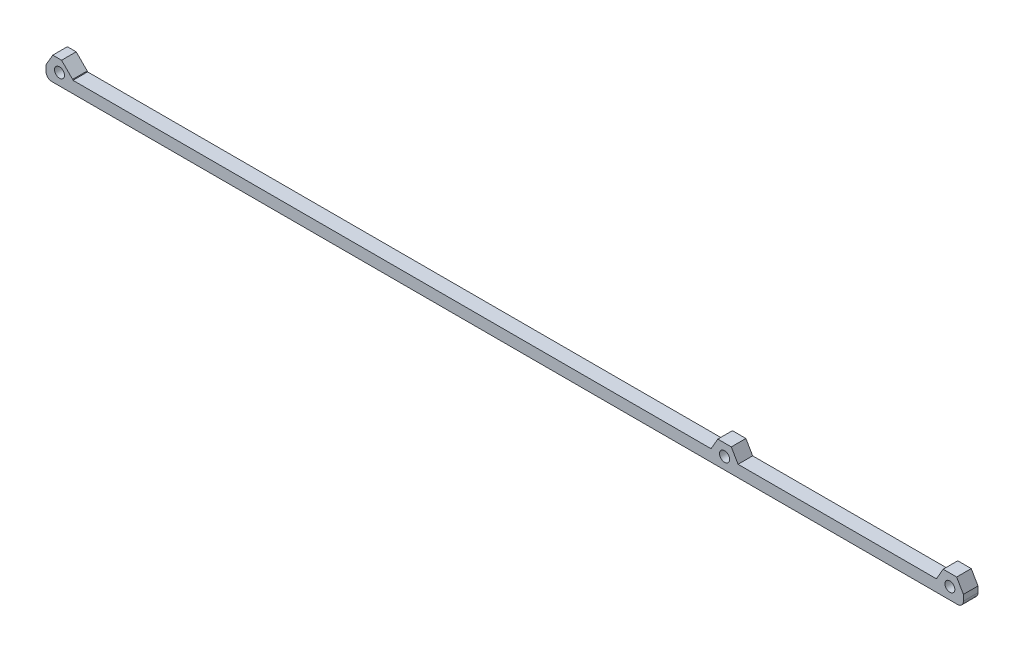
ISO-10303-21;
HEADER;
FILE_DESCRIPTION(('STEP AP214'),'2;1');
FILE_NAME('part.step','',(''),(''),'','','');
FILE_SCHEMA(('AUTOMOTIVE_DESIGN { 1 0 10303 214 1 1 1 1 }'));
ENDSEC;
DATA;
#1=APPLICATION_CONTEXT('core data for automotive mechanical design processes');
#2=APPLICATION_PROTOCOL_DEFINITION('international standard','automotive_design',2000,#1);
#3=PRODUCT_CONTEXT('',#1,'mechanical');
#4=PRODUCT('Part','Part','',(#3));
#5=PRODUCT_RELATED_PRODUCT_CATEGORY('part','',(#4));
#6=PRODUCT_DEFINITION_FORMATION('','',#4);
#7=PRODUCT_DEFINITION_CONTEXT('part definition',#1,'design');
#8=PRODUCT_DEFINITION('design','',#6,#7);
#9=PRODUCT_DEFINITION_SHAPE('','',#8);
#10=(LENGTH_UNIT() NAMED_UNIT(*) SI_UNIT(.MILLI.,.METRE.));
#11=(NAMED_UNIT(*) PLANE_ANGLE_UNIT() SI_UNIT($,.RADIAN.));
#12=(NAMED_UNIT(*) SI_UNIT($,.STERADIAN.) SOLID_ANGLE_UNIT());
#13=UNCERTAINTY_MEASURE_WITH_UNIT(LENGTH_MEASURE(1.E-05),#10,'distance_accuracy_value','');
#14=(GEOMETRIC_REPRESENTATION_CONTEXT(3) GLOBAL_UNCERTAINTY_ASSIGNED_CONTEXT((#13)) GLOBAL_UNIT_ASSIGNED_CONTEXT((#10,
#11,#12)) REPRESENTATION_CONTEXT('',''));
#15=CARTESIAN_POINT('',(0.,0.,0.));
#16=DIRECTION('',(0.,0.,1.));
#17=DIRECTION('',(1.,0.,0.));
#18=AXIS2_PLACEMENT_3D('',#15,#16,#17);
#19=CARTESIAN_POINT('',(398.78,5.08,6.35));
#20=DIRECTION('',(0.,-1.,0.));
#21=DIRECTION('',(1.,0.,0.));
#22=AXIS2_PLACEMENT_3D('',#19,#20,#21);
#23=PLANE('',#22);
#24=DIRECTION('',(-1.,0.,0.));
#25=VECTOR('',#24,1.);
#26=CARTESIAN_POINT('',(398.78,5.08,0.));
#27=LINE('',#26,#25);
#28=CARTESIAN_POINT('',(289.093910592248,5.08,0.));
#29=VERTEX_POINT('',#28);
#30=CARTESIAN_POINT('',(11.7317574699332,5.07999999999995,0.));
#31=VERTEX_POINT('',#30);
#32=EDGE_CURVE('E169',#29,#31,#27,.T.);
#33=ORIENTED_EDGE('',*,*,#32,.T.);
#34=DIRECTION('',(0.,0.,1.));
#35=VECTOR('',#34,1.);
#36=CARTESIAN_POINT('',(11.7317574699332,5.07999999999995,0.));
#37=LINE('',#36,#35);
#38=CARTESIAN_POINT('',(11.7317574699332,5.07999999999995,6.35));
#39=VERTEX_POINT('',#38);
#40=EDGE_CURVE('E150',#31,#39,#37,.T.);
#41=ORIENTED_EDGE('',*,*,#40,.T.);
#42=DIRECTION('',(-1.,0.,0.));
#43=VECTOR('',#42,1.);
#44=CARTESIAN_POINT('',(398.78,5.08,6.35));
#45=LINE('',#44,#43);
#46=CARTESIAN_POINT('',(289.093910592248,5.07999999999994,6.35));
#47=VERTEX_POINT('',#46);
#48=EDGE_CURVE('E221',#47,#39,#45,.T.);
#49=ORIENTED_EDGE('',*,*,#48,.F.);
#50=DIRECTION('',(0.,0.,1.));
#51=VECTOR('',#50,1.);
#52=CARTESIAN_POINT('',(289.093910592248,5.08,0.));
#53=LINE('',#52,#51);
#54=EDGE_CURVE('E176',#29,#47,#53,.T.);
#55=ORIENTED_EDGE('',*,*,#54,.F.);
#56=EDGE_LOOP('',(#33,#41,#49,#55));
#57=FACE_BOUND('',#56,.T.);
#58=ADVANCED_FACE('F33',(#57),#23,.F.);
#59=CARTESIAN_POINT('',(398.78,0.,6.35));
#60=DIRECTION('',(-1.,0.,0.));
#61=DIRECTION('',(0.,0.,1.));
#62=AXIS2_PLACEMENT_3D('',#59,#60,#61);
#63=PLANE('',#62);
#64=DIRECTION('',(0.,1.,0.));
#65=VECTOR('',#64,1.);
#66=CARTESIAN_POINT('',(398.78,0.,6.35));
#67=LINE('',#66,#65);
#68=CARTESIAN_POINT('',(398.78,2.54,6.35));
#69=VERTEX_POINT('',#68);
#70=CARTESIAN_POINT('',(398.78,5.07999999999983,6.35));
#71=VERTEX_POINT('',#70);
#72=EDGE_CURVE('E189',#69,#71,#67,.T.);
#73=ORIENTED_EDGE('',*,*,#72,.F.);
#74=DIRECTION('',(0.,0.,-1.));
#75=VECTOR('',#74,1.);
#76=CARTESIAN_POINT('',(398.78,2.54,6.35));
#77=LINE('',#76,#75);
#78=CARTESIAN_POINT('',(398.78,2.54,0.));
#79=VERTEX_POINT('',#78);
#80=EDGE_CURVE('E213',#69,#79,#77,.T.);
#81=ORIENTED_EDGE('',*,*,#80,.T.);
#82=DIRECTION('',(0.,1.,0.));
#83=VECTOR('',#82,1.);
#84=CARTESIAN_POINT('',(398.78,0.,0.));
#85=LINE('',#84,#83);
#86=CARTESIAN_POINT('',(398.78,5.07999999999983,0.));
#87=VERTEX_POINT('',#86);
#88=EDGE_CURVE('E178',#79,#87,#85,.T.);
#89=ORIENTED_EDGE('',*,*,#88,.T.);
#90=DIRECTION('',(0.,0.,-1.));
#91=VECTOR('',#90,1.);
#92=CARTESIAN_POINT('',(398.78,5.08,6.35));
#93=LINE('',#92,#91);
#94=EDGE_CURVE('E193',#71,#87,#93,.T.);
#95=ORIENTED_EDGE('',*,*,#94,.F.);
#96=EDGE_LOOP('',(#73,#81,#89,#95));
#97=FACE_BOUND('',#96,.T.);
#98=ADVANCED_FACE('F309',(#97),#63,.F.);
#99=CARTESIAN_POINT('',(387.048242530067,5.08000000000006,6.35));
#100=VERTEX_POINT('',#99);
#101=CARTESIAN_POINT('',(300.825668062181,5.08,6.35));
#102=VERTEX_POINT('',#101);
#103=EDGE_CURVE('E291',#100,#102,#45,.T.);
#104=ORIENTED_EDGE('',*,*,#103,.F.);
#105=DIRECTION('',(0.,0.,1.));
#106=VECTOR('',#105,1.);
#107=CARTESIAN_POINT('',(387.048242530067,5.07999999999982,0.));
#108=LINE('',#107,#106);
#109=CARTESIAN_POINT('',(387.048242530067,5.07999999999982,0.));
#110=VERTEX_POINT('',#109);
#111=EDGE_CURVE('E253',#110,#100,#108,.T.);
#112=ORIENTED_EDGE('',*,*,#111,.F.);
#113=CARTESIAN_POINT('',(300.825668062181,5.08,0.));
#114=VERTEX_POINT('',#113);
#115=EDGE_CURVE('E177',#110,#114,#27,.T.);
#116=ORIENTED_EDGE('',*,*,#115,.T.);
#117=DIRECTION('',(0.,0.,1.));
#118=VECTOR('',#117,1.);
#119=CARTESIAN_POINT('',(300.825668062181,5.08,0.));
#120=LINE('',#119,#118);
#121=EDGE_CURVE('E275',#114,#102,#120,.T.);
#122=ORIENTED_EDGE('',*,*,#121,.T.);
#123=EDGE_LOOP('',(#104,#112,#116,#122));
#124=FACE_BOUND('',#123,.T.);
#125=ADVANCED_FACE('F325',(#124),#23,.F.);
#126=CARTESIAN_POINT('',(0.,0.,6.35));
#127=DIRECTION('',(1.,0.,0.));
#128=DIRECTION('',(0.,0.,-1.));
#129=AXIS2_PLACEMENT_3D('',#126,#127,#128);
#130=PLANE('',#129);
#131=DIRECTION('',(0.,-1.,0.));
#132=VECTOR('',#131,1.);
#133=CARTESIAN_POINT('',(0.,0.,0.));
#134=LINE('',#133,#132);
#135=CARTESIAN_POINT('',(0.,5.07999999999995,0.));
#136=VERTEX_POINT('',#135);
#137=CARTESIAN_POINT('',(0.,2.53999999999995,0.));
#138=VERTEX_POINT('',#137);
#139=EDGE_CURVE('E180',#136,#138,#134,.T.);
#140=ORIENTED_EDGE('',*,*,#139,.T.);
#141=DIRECTION('',(0.,0.,-1.));
#142=VECTOR('',#141,1.);
#143=CARTESIAN_POINT('',(0.,2.53999999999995,6.35));
#144=LINE('',#143,#142);
#145=CARTESIAN_POINT('',(0.,2.53999999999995,6.35));
#146=VERTEX_POINT('',#145);
#147=EDGE_CURVE('E207',#138,#146,#144,.F.);
#148=ORIENTED_EDGE('',*,*,#147,.T.);
#149=DIRECTION('',(0.,-1.,0.));
#150=VECTOR('',#149,1.);
#151=CARTESIAN_POINT('',(0.,0.,6.35));
#152=LINE('',#151,#150);
#153=CARTESIAN_POINT('',(0.,5.07999999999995,6.35));
#154=VERTEX_POINT('',#153);
#155=EDGE_CURVE('E293',#154,#146,#152,.T.);
#156=ORIENTED_EDGE('',*,*,#155,.F.);
#157=DIRECTION('',(0.,0.,-1.));
#158=VECTOR('',#157,1.);
#159=CARTESIAN_POINT('',(0.,5.07999999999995,6.35));
#160=LINE('',#159,#158);
#161=EDGE_CURVE('E190',#154,#136,#160,.T.);
#162=ORIENTED_EDGE('',*,*,#161,.T.);
#163=EDGE_LOOP('',(#140,#148,#156,#162));
#164=FACE_BOUND('',#163,.T.);
#165=ADVANCED_FACE('F355',(#164),#130,.F.);
#166=CARTESIAN_POINT('',(398.78,0.,6.35));
#167=DIRECTION('',(0.,1.,0.));
#168=DIRECTION('',(-1.,0.,0.));
#169=AXIS2_PLACEMENT_3D('',#166,#167,#168);
#170=PLANE('',#169);
#171=DIRECTION('',(0.,0.,-1.));
#172=VECTOR('',#171,1.);
#173=CARTESIAN_POINT('',(396.24,0.,6.35));
#174=LINE('',#173,#172);
#175=CARTESIAN_POINT('',(396.24,0.,0.));
#176=VERTEX_POINT('',#175);
#177=CARTESIAN_POINT('',(396.24,0.,6.35));
#178=VERTEX_POINT('',#177);
#179=EDGE_CURVE('E196',#176,#178,#174,.F.);
#180=ORIENTED_EDGE('',*,*,#179,.T.);
#181=DIRECTION('',(1.,0.,0.));
#182=VECTOR('',#181,1.);
#183=CARTESIAN_POINT('',(398.78,0.,6.35));
#184=LINE('',#183,#182);
#185=CARTESIAN_POINT('',(2.53999999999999,0.,6.35));
#186=VERTEX_POINT('',#185);
#187=EDGE_CURVE('E194',#186,#178,#184,.T.);
#188=ORIENTED_EDGE('',*,*,#187,.F.);
#189=DIRECTION('',(0.,0.,-1.));
#190=VECTOR('',#189,1.);
#191=CARTESIAN_POINT('',(2.53999999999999,0.,6.35));
#192=LINE('',#191,#190);
#193=CARTESIAN_POINT('',(2.53999999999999,0.,0.));
#194=VERTEX_POINT('',#193);
#195=EDGE_CURVE('E199',#186,#194,#192,.T.);
#196=ORIENTED_EDGE('',*,*,#195,.T.);
#197=DIRECTION('',(1.,0.,0.));
#198=VECTOR('',#197,1.);
#199=CARTESIAN_POINT('',(398.78,0.,0.));
#200=LINE('',#199,#198);
#201=EDGE_CURVE('E187',#194,#176,#200,.T.);
#202=ORIENTED_EDGE('',*,*,#201,.T.);
#203=EDGE_LOOP('',(#180,#188,#196,#202));
#204=FACE_BOUND('',#203,.T.);
#205=ADVANCED_FACE('F302',(#204),#170,.F.);
#206=CARTESIAN_POINT('',(0.,0.,6.35));
#207=DIRECTION('',(0.,0.,1.));
#208=DIRECTION('',(1.,0.,0.));
#209=AXIS2_PLACEMENT_3D('',#206,#207,#208);
#210=PLANE('',#209);
#211=CARTESIAN_POINT('',(5.86587873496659,5.07999999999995,6.35));
#212=DIRECTION('',(0.,0.,1.));
#213=DIRECTION('',(1.,0.,0.));
#214=AXIS2_PLACEMENT_3D('',#211,#212,#213);
#215=CIRCLE('',#214,2.15);
#216=CARTESIAN_POINT('',(8.01587873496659,5.07999999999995,6.35));
#217=VERTEX_POINT('',#216);
#218=EDGE_CURVE('E414',#217,#217,#215,.T.);
#219=ORIENTED_EDGE('',*,*,#218,.F.);
#220=EDGE_LOOP('',(#219));
#221=FACE_BOUND('',#220,.T.);
#222=CARTESIAN_POINT('',(392.914121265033,5.08000000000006,6.35));
#223=DIRECTION('',(0.,0.,1.));
#224=DIRECTION('',(1.,0.,0.));
#225=AXIS2_PLACEMENT_3D('',#222,#223,#224);
#226=CIRCLE('',#225,2.14999999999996);
#227=CARTESIAN_POINT('',(395.064121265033,5.08000000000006,6.35));
#228=VERTEX_POINT('',#227);
#229=EDGE_CURVE('E227',#228,#228,#226,.T.);
#230=ORIENTED_EDGE('',*,*,#229,.F.);
#231=EDGE_LOOP('',(#230));
#232=FACE_BOUND('',#231,.T.);
#233=DIRECTION('',(-0.5,0.866025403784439,0.));
#234=VECTOR('',#233,1.);
#235=CARTESIAN_POINT('',(11.7317574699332,5.07999999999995,6.35));
#236=LINE('',#235,#234);
#237=CARTESIAN_POINT('',(11.5745817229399,5.35223637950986,6.35));
#238=VERTEX_POINT('',#237);
#239=EDGE_CURVE('E156',#39,#238,#236,.T.);
#240=ORIENTED_EDGE('',*,*,#239,.T.);
#241=DIRECTION('',(0.707106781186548,-0.707106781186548,0.));
#242=VECTOR('',#241,1.);
#243=CARTESIAN_POINT('',(8.4634090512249,8.4634090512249,6.35));
#244=LINE('',#243,#242);
#245=CARTESIAN_POINT('',(6.76681810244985,10.1599999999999,6.35));
#246=VERTEX_POINT('',#245);
#247=EDGE_CURVE('E55',#238,#246,#244,.F.);
#248=ORIENTED_EDGE('',*,*,#247,.T.);
#249=DIRECTION('',(-1.,0.,0.));
#250=VECTOR('',#249,1.);
#251=CARTESIAN_POINT('',(8.79881810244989,10.1599999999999,6.35));
#252=LINE('',#251,#250);
#253=CARTESIAN_POINT('',(2.9329393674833,10.1599999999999,6.35));
#254=VERTEX_POINT('',#253);
#255=EDGE_CURVE('E222',#246,#254,#252,.T.);
#256=ORIENTED_EDGE('',*,*,#255,.T.);
#257=DIRECTION('',(-0.500000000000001,-0.866025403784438,0.));
#258=VECTOR('',#257,1.);
#259=CARTESIAN_POINT('',(2.9329393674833,10.1599999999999,6.35));
#260=LINE('',#259,#258);
#261=EDGE_CURVE('E172',#254,#154,#260,.T.);
#262=ORIENTED_EDGE('',*,*,#261,.T.);
#263=ORIENTED_EDGE('',*,*,#155,.T.);
#264=CARTESIAN_POINT('',(2.53999999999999,2.53999999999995,6.35));
#265=DIRECTION('',(0.,0.,1.));
#266=DIRECTION('',(1.,0.,0.));
#267=AXIS2_PLACEMENT_3D('',#264,#265,#266);
#268=CIRCLE('',#267,2.54);
#269=EDGE_CURVE('E211',#146,#186,#268,.T.);
#270=ORIENTED_EDGE('',*,*,#269,.T.);
#271=ORIENTED_EDGE('',*,*,#187,.T.);
#272=CARTESIAN_POINT('',(396.24,2.54,6.35));
#273=DIRECTION('',(0.,0.,1.));
#274=DIRECTION('',(1.,0.,0.));
#275=AXIS2_PLACEMENT_3D('',#272,#273,#274);
#276=CIRCLE('',#275,2.54);
#277=EDGE_CURVE('E209',#178,#69,#276,.T.);
#278=ORIENTED_EDGE('',*,*,#277,.T.);
#279=ORIENTED_EDGE('',*,*,#72,.T.);
#280=DIRECTION('',(-0.500000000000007,0.866025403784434,0.));
#281=VECTOR('',#280,1.);
#282=CARTESIAN_POINT('',(398.78,5.07999999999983,6.35));
#283=LINE('',#282,#281);
#284=CARTESIAN_POINT('',(395.847060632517,10.1599999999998,6.35));
#285=VERTEX_POINT('',#284);
#286=EDGE_CURVE('E235',#71,#285,#283,.T.);
#287=ORIENTED_EDGE('',*,*,#286,.T.);
#288=DIRECTION('',(-1.,0.,0.));
#289=VECTOR('',#288,1.);
#290=CARTESIAN_POINT('',(395.847060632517,10.1599999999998,6.35));
#291=LINE('',#290,#289);
#292=CARTESIAN_POINT('',(389.98118189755,10.1599999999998,6.35));
#293=VERTEX_POINT('',#292);
#294=EDGE_CURVE('E249',#285,#293,#291,.T.);
#295=ORIENTED_EDGE('',*,*,#294,.T.);
#296=DIRECTION('',(-0.499999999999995,-0.866025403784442,0.));
#297=VECTOR('',#296,1.);
#298=CARTESIAN_POINT('',(389.98118189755,10.1599999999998,6.35));
#299=LINE('',#298,#297);
#300=EDGE_CURVE('E241',#293,#100,#299,.T.);
#301=ORIENTED_EDGE('',*,*,#300,.T.);
#302=ORIENTED_EDGE('',*,*,#103,.T.);
#303=DIRECTION('',(-0.499999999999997,0.86602540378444,0.));
#304=VECTOR('',#303,1.);
#305=CARTESIAN_POINT('',(300.825668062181,5.08,6.35));
#306=LINE('',#305,#304);
#307=CARTESIAN_POINT('',(297.892728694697,10.16,6.35));
#308=VERTEX_POINT('',#307);
#309=EDGE_CURVE('E263',#102,#308,#306,.T.);
#310=ORIENTED_EDGE('',*,*,#309,.T.);
#311=DIRECTION('',(-1.,0.,0.));
#312=VECTOR('',#311,1.);
#313=CARTESIAN_POINT('',(297.892728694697,10.16,6.35));
#314=LINE('',#313,#312);
#315=CARTESIAN_POINT('',(292.026849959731,10.16,6.35));
#316=VERTEX_POINT('',#315);
#317=EDGE_CURVE('E278',#308,#316,#314,.T.);
#318=ORIENTED_EDGE('',*,*,#317,.T.);
#319=DIRECTION('',(-0.499999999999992,-0.866025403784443,0.));
#320=VECTOR('',#319,1.);
#321=CARTESIAN_POINT('',(292.026849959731,10.16,6.35));
#322=LINE('',#321,#320);
#323=EDGE_CURVE('E270',#316,#47,#322,.T.);
#324=ORIENTED_EDGE('',*,*,#323,.T.);
#325=ORIENTED_EDGE('',*,*,#48,.T.);
#326=EDGE_LOOP('',(#240,#248,#256,#262,#263,#270,#271,#278,#279,#287,#295,#301,#302,#310,#318,
#324,#325));
#327=FACE_BOUND('',#326,.T.);
#328=CARTESIAN_POINT('',(294.959789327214,5.07999999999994,6.35));
#329=DIRECTION('',(0.,0.,1.));
#330=DIRECTION('',(1.,0.,0.));
#331=AXIS2_PLACEMENT_3D('',#328,#329,#330);
#332=CIRCLE('',#331,2.19999999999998);
#333=CARTESIAN_POINT('',(297.159789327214,5.07999999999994,6.35));
#334=VERTEX_POINT('',#333);
#335=EDGE_CURVE('E256',#334,#334,#332,.T.);
#336=ORIENTED_EDGE('',*,*,#335,.F.);
#337=EDGE_LOOP('',(#336));
#338=FACE_BOUND('',#337,.T.);
#339=ADVANCED_FACE('F219',(#221,#232,#327,#338),#210,.T.);
#340=CARTESIAN_POINT('',(0.,0.,0.));
#341=DIRECTION('',(0.,0.,1.));
#342=DIRECTION('',(1.,0.,0.));
#343=AXIS2_PLACEMENT_3D('',#340,#341,#342);
#344=PLANE('',#343);
#345=CARTESIAN_POINT('',(5.86587873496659,5.07999999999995,0.));
#346=DIRECTION('',(0.,0.,1.));
#347=DIRECTION('',(1.,0.,0.));
#348=AXIS2_PLACEMENT_3D('',#345,#346,#347);
#349=CIRCLE('',#348,2.15);
#350=CARTESIAN_POINT('',(8.01587873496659,5.07999999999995,0.));
#351=VERTEX_POINT('',#350);
#352=EDGE_CURVE('E411',#351,#351,#349,.T.);
#353=ORIENTED_EDGE('',*,*,#352,.T.);
#354=EDGE_LOOP('',(#353));
#355=FACE_BOUND('',#354,.T.);
#356=CARTESIAN_POINT('',(392.914121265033,5.08000000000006,0.));
#357=DIRECTION('',(0.,0.,1.));
#358=DIRECTION('',(1.,0.,0.));
#359=AXIS2_PLACEMENT_3D('',#356,#357,#358);
#360=CIRCLE('',#359,2.14999999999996);
#361=CARTESIAN_POINT('',(395.064121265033,5.08000000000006,0.));
#362=VERTEX_POINT('',#361);
#363=EDGE_CURVE('E223',#362,#362,#360,.T.);
#364=ORIENTED_EDGE('',*,*,#363,.T.);
#365=EDGE_LOOP('',(#364));
#366=FACE_BOUND('',#365,.T.);
#367=DIRECTION('',(-1.,0.,0.));
#368=VECTOR('',#367,1.);
#369=CARTESIAN_POINT('',(8.79881810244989,10.1599999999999,0.));
#370=LINE('',#369,#368);
#371=CARTESIAN_POINT('',(6.76681810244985,10.1599999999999,0.));
#372=VERTEX_POINT('',#371);
#373=CARTESIAN_POINT('',(2.9329393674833,10.1599999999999,0.));
#374=VERTEX_POINT('',#373);
#375=EDGE_CURVE('E171',#372,#374,#370,.T.);
#376=ORIENTED_EDGE('',*,*,#375,.F.);
#377=DIRECTION('',(-0.707106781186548,0.707106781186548,0.));
#378=VECTOR('',#377,1.);
#379=CARTESIAN_POINT('',(11.5745817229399,5.35223637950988,0.));
#380=LINE('',#379,#378);
#381=CARTESIAN_POINT('',(11.5745817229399,5.35223637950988,0.));
#382=VERTEX_POINT('',#381);
#383=EDGE_CURVE('E11',#372,#382,#380,.F.);
#384=ORIENTED_EDGE('',*,*,#383,.T.);
#385=DIRECTION('',(-0.5,0.866025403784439,0.));
#386=VECTOR('',#385,1.);
#387=CARTESIAN_POINT('',(11.7317574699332,5.07999999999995,0.));
#388=LINE('',#387,#386);
#389=EDGE_CURVE('E154',#31,#382,#388,.T.);
#390=ORIENTED_EDGE('',*,*,#389,.F.);
#391=ORIENTED_EDGE('',*,*,#32,.F.);
#392=DIRECTION('',(-0.499999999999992,-0.866025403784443,0.));
#393=VECTOR('',#392,1.);
#394=CARTESIAN_POINT('',(292.026849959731,10.16,0.));
#395=LINE('',#394,#393);
#396=CARTESIAN_POINT('',(292.026849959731,10.16,0.));
#397=VERTEX_POINT('',#396);
#398=EDGE_CURVE('E273',#397,#29,#395,.T.);
#399=ORIENTED_EDGE('',*,*,#398,.F.);
#400=DIRECTION('',(-1.,0.,0.));
#401=VECTOR('',#400,1.);
#402=CARTESIAN_POINT('',(297.892728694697,10.16,0.));
#403=LINE('',#402,#401);
#404=CARTESIAN_POINT('',(297.892728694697,10.16,0.));
#405=VERTEX_POINT('',#404);
#406=EDGE_CURVE('E269',#405,#397,#403,.T.);
#407=ORIENTED_EDGE('',*,*,#406,.F.);
#408=DIRECTION('',(-0.499999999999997,0.86602540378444,0.));
#409=VECTOR('',#408,1.);
#410=CARTESIAN_POINT('',(300.825668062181,5.08,0.));
#411=LINE('',#410,#409);
#412=EDGE_CURVE('E266',#114,#405,#411,.T.);
#413=ORIENTED_EDGE('',*,*,#412,.F.);
#414=ORIENTED_EDGE('',*,*,#115,.F.);
#415=DIRECTION('',(-0.499999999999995,-0.866025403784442,0.));
#416=VECTOR('',#415,1.);
#417=CARTESIAN_POINT('',(389.98118189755,10.1599999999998,0.));
#418=LINE('',#417,#416);
#419=CARTESIAN_POINT('',(389.98118189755,10.1599999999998,0.));
#420=VERTEX_POINT('',#419);
#421=EDGE_CURVE('E244',#420,#110,#418,.T.);
#422=ORIENTED_EDGE('',*,*,#421,.F.);
#423=DIRECTION('',(-1.,0.,0.));
#424=VECTOR('',#423,1.);
#425=CARTESIAN_POINT('',(395.847060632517,10.1599999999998,0.));
#426=LINE('',#425,#424);
#427=CARTESIAN_POINT('',(395.847060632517,10.1599999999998,0.));
#428=VERTEX_POINT('',#427);
#429=EDGE_CURVE('E240',#428,#420,#426,.T.);
#430=ORIENTED_EDGE('',*,*,#429,.F.);
#431=DIRECTION('',(-0.500000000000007,0.866025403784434,0.));
#432=VECTOR('',#431,1.);
#433=CARTESIAN_POINT('',(398.78,5.07999999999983,0.));
#434=LINE('',#433,#432);
#435=EDGE_CURVE('E237',#87,#428,#434,.T.);
#436=ORIENTED_EDGE('',*,*,#435,.F.);
#437=ORIENTED_EDGE('',*,*,#88,.F.);
#438=CARTESIAN_POINT('',(396.24,2.54,0.));
#439=DIRECTION('',(0.,0.,1.));
#440=DIRECTION('',(1.,0.,0.));
#441=AXIS2_PLACEMENT_3D('',#438,#439,#440);
#442=CIRCLE('',#441,2.54);
#443=EDGE_CURVE('E202',#79,#176,#442,.F.);
#444=ORIENTED_EDGE('',*,*,#443,.T.);
#445=ORIENTED_EDGE('',*,*,#201,.F.);
#446=CARTESIAN_POINT('',(2.53999999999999,2.53999999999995,0.));
#447=DIRECTION('',(0.,0.,1.));
#448=DIRECTION('',(1.,0.,0.));
#449=AXIS2_PLACEMENT_3D('',#446,#447,#448);
#450=CIRCLE('',#449,2.54);
#451=EDGE_CURVE('E205',#194,#138,#450,.F.);
#452=ORIENTED_EDGE('',*,*,#451,.T.);
#453=ORIENTED_EDGE('',*,*,#139,.F.);
#454=DIRECTION('',(-0.500000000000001,-0.866025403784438,0.));
#455=VECTOR('',#454,1.);
#456=CARTESIAN_POINT('',(2.9329393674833,10.1599999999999,0.));
#457=LINE('',#456,#455);
#458=EDGE_CURVE('E162',#374,#136,#457,.T.);
#459=ORIENTED_EDGE('',*,*,#458,.F.);
#460=EDGE_LOOP('',(#376,#384,#390,#391,#399,#407,#413,#414,#422,#430,#436,#437,#444,#445,#452,
#453,#459));
#461=FACE_BOUND('',#460,.T.);
#462=CARTESIAN_POINT('',(294.959789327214,5.07999999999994,0.));
#463=DIRECTION('',(0.,0.,1.));
#464=DIRECTION('',(1.,0.,0.));
#465=AXIS2_PLACEMENT_3D('',#462,#463,#464);
#466=CIRCLE('',#465,2.19999999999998);
#467=CARTESIAN_POINT('',(297.159789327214,5.07999999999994,0.));
#468=VERTEX_POINT('',#467);
#469=EDGE_CURVE('E260',#468,#468,#466,.T.);
#470=ORIENTED_EDGE('',*,*,#469,.T.);
#471=EDGE_LOOP('',(#470));
#472=FACE_BOUND('',#471,.T.);
#473=ADVANCED_FACE('F166',(#355,#366,#461,#472),#344,.F.);
#474=CARTESIAN_POINT('',(2.53999999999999,2.53999999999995,6.35));
#475=DIRECTION('',(0.,0.,-1.));
#476=DIRECTION('',(-1.,0.,0.));
#477=AXIS2_PLACEMENT_3D('',#474,#475,#476);
#478=CYLINDRICAL_SURFACE('',#477,2.54);
#479=ORIENTED_EDGE('',*,*,#269,.F.);
#480=ORIENTED_EDGE('',*,*,#147,.F.);
#481=ORIENTED_EDGE('',*,*,#451,.F.);
#482=ORIENTED_EDGE('',*,*,#195,.F.);
#483=EDGE_LOOP('',(#479,#480,#481,#482));
#484=FACE_BOUND('',#483,.T.);
#485=ADVANCED_FACE('F345',(#484),#478,.T.);
#486=CARTESIAN_POINT('',(396.24,2.54,6.35));
#487=DIRECTION('',(0.,0.,-1.));
#488=DIRECTION('',(-1.,0.,0.));
#489=AXIS2_PLACEMENT_3D('',#486,#487,#488);
#490=CYLINDRICAL_SURFACE('',#489,2.54);
#491=ORIENTED_EDGE('',*,*,#277,.F.);
#492=ORIENTED_EDGE('',*,*,#179,.F.);
#493=ORIENTED_EDGE('',*,*,#443,.F.);
#494=ORIENTED_EDGE('',*,*,#80,.F.);
#495=EDGE_LOOP('',(#491,#492,#493,#494));
#496=FACE_BOUND('',#495,.T.);
#497=ADVANCED_FACE('F306',(#496),#490,.T.);
#498=CARTESIAN_POINT('',(292.026849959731,10.16,0.));
#499=DIRECTION('',(-0.866025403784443,0.499999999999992,0.));
#500=DIRECTION('',(-0.499999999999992,-0.866025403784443,0.));
#501=AXIS2_PLACEMENT_3D('',#498,#499,#500);
#502=PLANE('',#501);
#503=ORIENTED_EDGE('',*,*,#323,.F.);
#504=DIRECTION('',(0.,0.,1.));
#505=VECTOR('',#504,1.);
#506=CARTESIAN_POINT('',(292.026849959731,10.16,0.));
#507=LINE('',#506,#505);
#508=EDGE_CURVE('E283',#397,#316,#507,.T.);
#509=ORIENTED_EDGE('',*,*,#508,.F.);
#510=ORIENTED_EDGE('',*,*,#398,.T.);
#511=ORIENTED_EDGE('',*,*,#54,.T.);
#512=EDGE_LOOP('',(#503,#509,#510,#511));
#513=FACE_BOUND('',#512,.T.);
#514=ADVANCED_FACE('F337',(#513),#502,.T.);
#515=CARTESIAN_POINT('',(297.892728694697,10.16,0.));
#516=DIRECTION('',(0.,1.,0.));
#517=DIRECTION('',(-1.,0.,0.));
#518=AXIS2_PLACEMENT_3D('',#515,#516,#517);
#519=PLANE('',#518);
#520=ORIENTED_EDGE('',*,*,#317,.F.);
#521=DIRECTION('',(0.,0.,1.));
#522=VECTOR('',#521,1.);
#523=CARTESIAN_POINT('',(297.892728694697,10.16,0.));
#524=LINE('',#523,#522);
#525=EDGE_CURVE('E285',#405,#308,#524,.T.);
#526=ORIENTED_EDGE('',*,*,#525,.F.);
#527=ORIENTED_EDGE('',*,*,#406,.T.);
#528=ORIENTED_EDGE('',*,*,#508,.T.);
#529=EDGE_LOOP('',(#520,#526,#527,#528));
#530=FACE_BOUND('',#529,.T.);
#531=ADVANCED_FACE('F334',(#530),#519,.T.);
#532=CARTESIAN_POINT('',(300.825668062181,5.08,0.));
#533=DIRECTION('',(0.86602540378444,0.499999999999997,0.));
#534=DIRECTION('',(-0.499999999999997,0.86602540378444,0.));
#535=AXIS2_PLACEMENT_3D('',#532,#533,#534);
#536=PLANE('',#535);
#537=ORIENTED_EDGE('',*,*,#309,.F.);
#538=ORIENTED_EDGE('',*,*,#121,.F.);
#539=ORIENTED_EDGE('',*,*,#412,.T.);
#540=ORIENTED_EDGE('',*,*,#525,.T.);
#541=EDGE_LOOP('',(#537,#538,#539,#540));
#542=FACE_BOUND('',#541,.T.);
#543=ADVANCED_FACE('F329',(#542),#536,.T.);
#544=CARTESIAN_POINT('',(294.959789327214,5.07999999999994,0.));
#545=DIRECTION('',(0.,0.,1.));
#546=DIRECTION('',(1.,0.,0.));
#547=AXIS2_PLACEMENT_3D('',#544,#545,#546);
#548=CYLINDRICAL_SURFACE('',#547,2.19999999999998);
#549=ORIENTED_EDGE('',*,*,#469,.F.);
#550=EDGE_LOOP('',(#549));
#551=FACE_BOUND('',#550,.T.);
#552=ORIENTED_EDGE('',*,*,#335,.T.);
#553=EDGE_LOOP('',(#552));
#554=FACE_BOUND('',#553,.T.);
#555=ADVANCED_FACE('F372',(#551,#554),#548,.F.);
#556=CARTESIAN_POINT('',(389.98118189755,10.1599999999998,0.));
#557=DIRECTION('',(-0.866025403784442,0.499999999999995,0.));
#558=DIRECTION('',(-0.499999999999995,-0.866025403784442,0.));
#559=AXIS2_PLACEMENT_3D('',#556,#557,#558);
#560=PLANE('',#559);
#561=ORIENTED_EDGE('',*,*,#300,.F.);
#562=DIRECTION('',(0.,0.,1.));
#563=VECTOR('',#562,1.);
#564=CARTESIAN_POINT('',(389.98118189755,10.1599999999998,0.));
#565=LINE('',#564,#563);
#566=EDGE_CURVE('E257',#420,#293,#565,.T.);
#567=ORIENTED_EDGE('',*,*,#566,.F.);
#568=ORIENTED_EDGE('',*,*,#421,.T.);
#569=ORIENTED_EDGE('',*,*,#111,.T.);
#570=EDGE_LOOP('',(#561,#567,#568,#569));
#571=FACE_BOUND('',#570,.T.);
#572=ADVANCED_FACE('F320',(#571),#560,.T.);
#573=CARTESIAN_POINT('',(395.847060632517,10.1599999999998,0.));
#574=DIRECTION('',(0.,1.,0.));
#575=DIRECTION('',(-1.,0.,0.));
#576=AXIS2_PLACEMENT_3D('',#573,#574,#575);
#577=PLANE('',#576);
#578=ORIENTED_EDGE('',*,*,#294,.F.);
#579=DIRECTION('',(0.,0.,1.));
#580=VECTOR('',#579,1.);
#581=CARTESIAN_POINT('',(395.847060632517,10.1599999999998,0.));
#582=LINE('',#581,#580);
#583=EDGE_CURVE('E246',#428,#285,#582,.T.);
#584=ORIENTED_EDGE('',*,*,#583,.F.);
#585=ORIENTED_EDGE('',*,*,#429,.T.);
#586=ORIENTED_EDGE('',*,*,#566,.T.);
#587=EDGE_LOOP('',(#578,#584,#585,#586));
#588=FACE_BOUND('',#587,.T.);
#589=ADVANCED_FACE('F380',(#588),#577,.T.);
#590=CARTESIAN_POINT('',(398.78,5.07999999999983,0.));
#591=DIRECTION('',(0.866025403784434,0.500000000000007,0.));
#592=DIRECTION('',(-0.500000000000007,0.866025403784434,0.));
#593=AXIS2_PLACEMENT_3D('',#590,#591,#592);
#594=PLANE('',#593);
#595=ORIENTED_EDGE('',*,*,#286,.F.);
#596=ORIENTED_EDGE('',*,*,#94,.T.);
#597=ORIENTED_EDGE('',*,*,#435,.T.);
#598=ORIENTED_EDGE('',*,*,#583,.T.);
#599=EDGE_LOOP('',(#595,#596,#597,#598));
#600=FACE_BOUND('',#599,.T.);
#601=ADVANCED_FACE('F315',(#600),#594,.T.);
#602=CARTESIAN_POINT('',(2.9329393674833,10.1599999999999,0.));
#603=DIRECTION('',(-0.866025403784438,0.500000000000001,0.));
#604=DIRECTION('',(-0.500000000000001,-0.866025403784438,0.));
#605=AXIS2_PLACEMENT_3D('',#602,#603,#604);
#606=PLANE('',#605);
#607=ORIENTED_EDGE('',*,*,#261,.F.);
#608=DIRECTION('',(0.,0.,1.));
#609=VECTOR('',#608,1.);
#610=CARTESIAN_POINT('',(2.9329393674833,10.1599999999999,0.));
#611=LINE('',#610,#609);
#612=EDGE_CURVE('E161',#374,#254,#611,.T.);
#613=ORIENTED_EDGE('',*,*,#612,.F.);
#614=ORIENTED_EDGE('',*,*,#458,.T.);
#615=ORIENTED_EDGE('',*,*,#161,.F.);
#616=EDGE_LOOP('',(#607,#613,#614,#615));
#617=FACE_BOUND('',#616,.T.);
#618=ADVANCED_FACE('F387',(#617),#606,.T.);
#619=CARTESIAN_POINT('',(8.79881810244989,10.1599999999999,0.));
#620=DIRECTION('',(0.,1.,0.));
#621=DIRECTION('',(-1.,0.,0.));
#622=AXIS2_PLACEMENT_3D('',#619,#620,#621);
#623=PLANE('',#622);
#624=ORIENTED_EDGE('',*,*,#255,.F.);
#625=DIRECTION('',(0.,0.,-1.));
#626=VECTOR('',#625,1.);
#627=CARTESIAN_POINT('',(6.76681810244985,10.1599999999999,0.));
#628=LINE('',#627,#626);
#629=EDGE_CURVE('E41',#246,#372,#628,.T.);
#630=ORIENTED_EDGE('',*,*,#629,.T.);
#631=ORIENTED_EDGE('',*,*,#375,.T.);
#632=ORIENTED_EDGE('',*,*,#612,.T.);
#633=EDGE_LOOP('',(#624,#630,#631,#632));
#634=FACE_BOUND('',#633,.T.);
#635=ADVANCED_FACE('F393',(#634),#623,.T.);
#636=CARTESIAN_POINT('',(11.7317574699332,5.07999999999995,0.));
#637=DIRECTION('',(0.866025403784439,0.5,0.));
#638=DIRECTION('',(-0.5,0.866025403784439,0.));
#639=AXIS2_PLACEMENT_3D('',#636,#637,#638);
#640=PLANE('',#639);
#641=ORIENTED_EDGE('',*,*,#389,.T.);
#642=DIRECTION('',(0.,0.,1.));
#643=VECTOR('',#642,1.);
#644=CARTESIAN_POINT('',(11.5745817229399,5.35223637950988,0.));
#645=LINE('',#644,#643);
#646=EDGE_CURVE('E216',#382,#238,#645,.T.);
#647=ORIENTED_EDGE('',*,*,#646,.T.);
#648=ORIENTED_EDGE('',*,*,#239,.F.);
#649=ORIENTED_EDGE('',*,*,#40,.F.);
#650=EDGE_LOOP('',(#641,#647,#648,#649));
#651=FACE_BOUND('',#650,.T.);
#652=ADVANCED_FACE('F152',(#651),#640,.T.);
#653=CARTESIAN_POINT('',(392.914121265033,5.08000000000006,0.));
#654=DIRECTION('',(0.,0.,1.));
#655=DIRECTION('',(1.,0.,0.));
#656=AXIS2_PLACEMENT_3D('',#653,#654,#655);
#657=CYLINDRICAL_SURFACE('',#656,2.14999999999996);
#658=ORIENTED_EDGE('',*,*,#363,.F.);
#659=EDGE_LOOP('',(#658));
#660=FACE_BOUND('',#659,.T.);
#661=ORIENTED_EDGE('',*,*,#229,.T.);
#662=EDGE_LOOP('',(#661));
#663=FACE_BOUND('',#662,.T.);
#664=ADVANCED_FACE('F392',(#660,#663),#657,.F.);
#665=CARTESIAN_POINT('',(5.86587873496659,5.07999999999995,0.));
#666=DIRECTION('',(0.,0.,1.));
#667=DIRECTION('',(1.,0.,0.));
#668=AXIS2_PLACEMENT_3D('',#665,#666,#667);
#669=CYLINDRICAL_SURFACE('',#668,2.15);
#670=ORIENTED_EDGE('',*,*,#352,.F.);
#671=EDGE_LOOP('',(#670));
#672=FACE_BOUND('',#671,.T.);
#673=ORIENTED_EDGE('',*,*,#218,.T.);
#674=EDGE_LOOP('',(#673));
#675=FACE_BOUND('',#674,.T.);
#676=ADVANCED_FACE('F401',(#672,#675),#669,.F.);
#677=CARTESIAN_POINT('',(11.5745817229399,5.35223637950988,0.));
#678=DIRECTION('',(-0.707106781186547,-0.707106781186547,0.));
#679=DIRECTION('',(0.,0.,1.));
#680=AXIS2_PLACEMENT_3D('',#677,#678,#679);
#681=PLANE('',#680);
#682=ORIENTED_EDGE('',*,*,#383,.F.);
#683=ORIENTED_EDGE('',*,*,#629,.F.);
#684=ORIENTED_EDGE('',*,*,#247,.F.);
#685=ORIENTED_EDGE('',*,*,#646,.F.);
#686=EDGE_LOOP('',(#682,#683,#684,#685));
#687=FACE_BOUND('',#686,.T.);
#688=ADVANCED_FACE('F35',(#687),#681,.F.);
#689=CLOSED_SHELL('',(#58,#98,#125,#165,#205,#339,#473,#485,#497,#514,#531,#543,#555,#572,#589,
#601,#618,#635,#652,#664,#676,#688));
#690=MANIFOLD_SOLID_BREP('B2',#689);
#691=ADVANCED_BREP_SHAPE_REPRESENTATION('',(#18,#690),#14);
#692=SHAPE_DEFINITION_REPRESENTATION(#9,#691);
ENDSEC;
END-ISO-10303-21;
